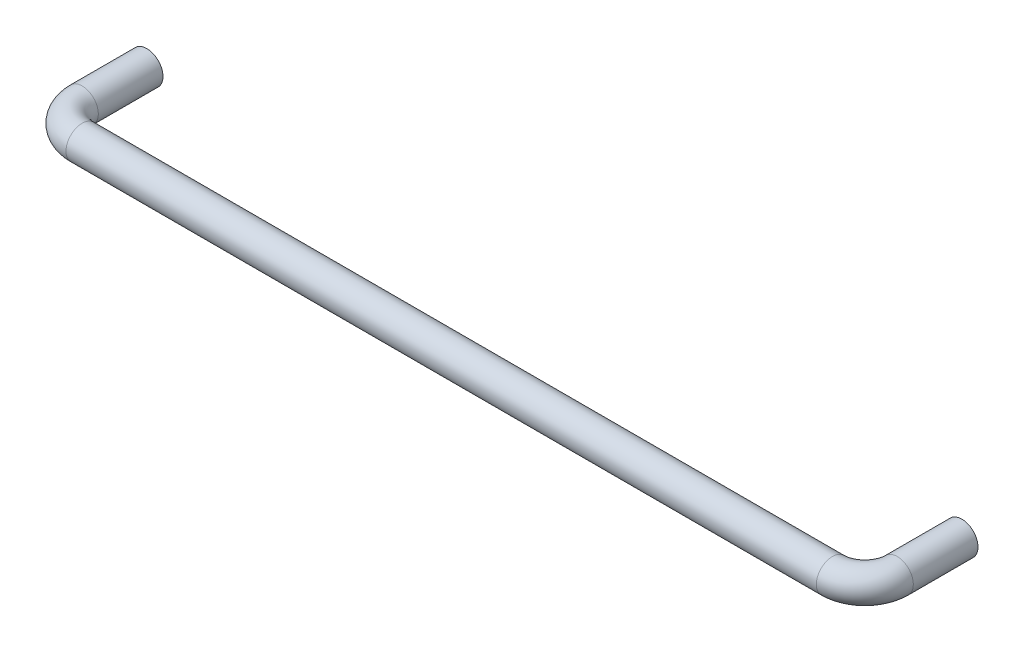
from build123d import *

# Parameters (mm, degrees)
SKETCH1_R                          = 5
M3_0_3_000000_DIAMETER_HOLE1_D     = 3
M3_0_3_000000_DIAMETER_HOLE1_DEPTH = 3
M3_0_3_000000_DIAMETER_HOLE1_TIP   = 0.901290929


with BuildPart() as part:
    # Base-Sweep: sweep along a curve in space
    with BuildLine() as base_sweep_path:
        Line((0, 0, 0), (0, 0, 20))
        ThreePointArc((0, 0, 20), (2.928932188, 0, 27.071067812), (10, 0, 30))
        Line((10, 0, 30), (126, 0, 30))
    # Sketch1 → Base-Sweep (sweep)
    with BuildSketch(Plane.XY):
        Circle(SKETCH1_R)
    sweep(path=base_sweep_path.line)

    # M3.0 _3.000000_ Diameter Hole1
    with Locations(Plane(origin=(0, 0, 0), x_dir=(-1, 0, 0), z_dir=(0, 0, -1))):
        with Locations((0, 0)):
            Hole(M3_0_3_000000_DIAMETER_HOLE1_D / 2, depth=M3_0_3_000000_DIAMETER_HOLE1_DEPTH)
            with Locations((0, 0, -(M3_0_3_000000_DIAMETER_HOLE1_DEPTH + M3_0_3_000000_DIAMETER_HOLE1_TIP / 2))):  # 118° drill point
                Cone(0, M3_0_3_000000_DIAMETER_HOLE1_D / 2, M3_0_3_000000_DIAMETER_HOLE1_TIP, mode=Mode.SUBTRACT)

    # Mirror All1: part across face


with BuildPart() as part_1:
    add(part.part)
    add(part.part.mirror(Plane(origin=(126, 0, 30), x_dir=(0, 0, 1), z_dir=(1, 0, 0))))


solid = part_1.part
